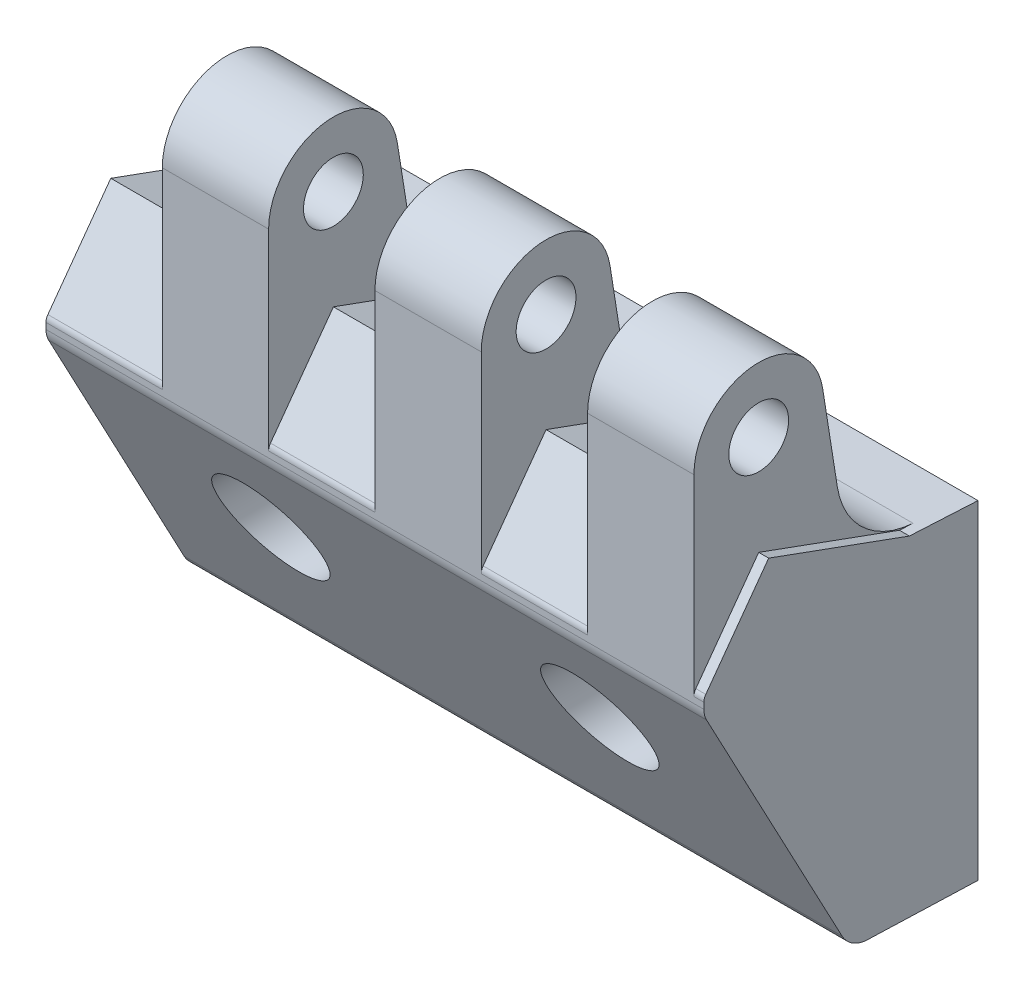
ISO-10303-21;
HEADER;
FILE_DESCRIPTION(('STEP AP214'),'2;1');
FILE_NAME('part.step','',(''),(''),'','','');
FILE_SCHEMA(('AUTOMOTIVE_DESIGN { 1 0 10303 214 1 1 1 1 }'));
ENDSEC;
DATA;
#1=APPLICATION_CONTEXT('core data for automotive mechanical design processes');
#2=APPLICATION_PROTOCOL_DEFINITION('international standard','automotive_design',2000,#1);
#3=PRODUCT_CONTEXT('',#1,'mechanical');
#4=PRODUCT('Part','Part','',(#3));
#5=PRODUCT_RELATED_PRODUCT_CATEGORY('part','',(#4));
#6=PRODUCT_DEFINITION_FORMATION('','',#4);
#7=PRODUCT_DEFINITION_CONTEXT('part definition',#1,'design');
#8=PRODUCT_DEFINITION('design','',#6,#7);
#9=PRODUCT_DEFINITION_SHAPE('','',#8);
#10=(LENGTH_UNIT() NAMED_UNIT(*) SI_UNIT(.MILLI.,.METRE.));
#11=(NAMED_UNIT(*) PLANE_ANGLE_UNIT() SI_UNIT($,.RADIAN.));
#12=(NAMED_UNIT(*) SI_UNIT($,.STERADIAN.) SOLID_ANGLE_UNIT());
#13=UNCERTAINTY_MEASURE_WITH_UNIT(LENGTH_MEASURE(1.E-05),#10,'distance_accuracy_value','');
#14=(GEOMETRIC_REPRESENTATION_CONTEXT(3) GLOBAL_UNCERTAINTY_ASSIGNED_CONTEXT((#13)) GLOBAL_UNIT_ASSIGNED_CONTEXT((#10,
#11,#12)) REPRESENTATION_CONTEXT('',''));
#15=CARTESIAN_POINT('',(0.,0.,0.));
#16=DIRECTION('',(0.,0.,1.));
#17=DIRECTION('',(1.,0.,0.));
#18=AXIS2_PLACEMENT_3D('',#15,#16,#17);
#19=CARTESIAN_POINT('',(-16.5,16.35,0.));
#20=DIRECTION('',(0.,0.998629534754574,-0.0523359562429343));
#21=DIRECTION('',(0.,0.0523359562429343,0.998629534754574));
#22=AXIS2_PLACEMENT_3D('',#19,#20,#21);
#23=PLANE('',#22);
#24=DIRECTION('',(-1.,0.,0.));
#25=VECTOR('',#24,1.);
#26=CARTESIAN_POINT('',(48.5,16.6393206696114,5.520567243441));
#27=LINE('',#26,#25);
#28=CARTESIAN_POINT('',(37.833333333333,16.6393206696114,5.52056724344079));
#29=VERTEX_POINT('',#28);
#30=CARTESIAN_POINT('',(48.5,16.6393206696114,5.520567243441));
#31=VERTEX_POINT('',#30);
#32=EDGE_CURVE('E29',#29,#31,#27,.F.);
#33=ORIENTED_EDGE('',*,*,#32,.T.);
#34=DIRECTION('',(0.,0.0523359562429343,0.998629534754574));
#35=VECTOR('',#34,1.);
#36=CARTESIAN_POINT('',(48.5,16.35,0.));
#37=LINE('',#36,#35);
#38=CARTESIAN_POINT('',(48.5,16.71068751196,6.8823277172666));
#39=VERTEX_POINT('',#38);
#40=EDGE_CURVE('E305',#31,#39,#37,.T.);
#41=ORIENTED_EDGE('',*,*,#40,.T.);
#42=DIRECTION('',(1.,0.,0.));
#43=VECTOR('',#42,1.);
#44=CARTESIAN_POINT('',(-16.5,16.71068751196,6.8823277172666));
#45=LINE('',#44,#43);
#46=CARTESIAN_POINT('',(49.5,16.71068751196,6.8823277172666));
#47=VERTEX_POINT('',#46);
#48=EDGE_CURVE('E508',#39,#47,#45,.T.);
#49=ORIENTED_EDGE('',*,*,#48,.T.);
#50=DIRECTION('',(0.,0.0523359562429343,0.998629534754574));
#51=VECTOR('',#50,1.);
#52=CARTESIAN_POINT('',(49.5,16.35,0.));
#53=LINE('',#52,#51);
#54=CARTESIAN_POINT('',(49.5,16.35,0.));
#55=VERTEX_POINT('',#54);
#56=EDGE_CURVE('E428',#55,#47,#53,.T.);
#57=ORIENTED_EDGE('',*,*,#56,.F.);
#58=DIRECTION('',(1.,0.,0.));
#59=VECTOR('',#58,1.);
#60=CARTESIAN_POINT('',(-16.5,16.35,0.));
#61=LINE('',#60,#59);
#62=CARTESIAN_POINT('',(-16.5,16.35,0.));
#63=VERTEX_POINT('',#62);
#64=EDGE_CURVE('E514',#63,#55,#61,.T.);
#65=ORIENTED_EDGE('',*,*,#64,.F.);
#66=DIRECTION('',(0.,0.0523359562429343,0.998629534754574));
#67=VECTOR('',#66,1.);
#68=CARTESIAN_POINT('',(-16.5,16.35,0.));
#69=LINE('',#68,#67);
#70=CARTESIAN_POINT('',(-16.5,16.71068751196,6.8823277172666));
#71=VERTEX_POINT('',#70);
#72=EDGE_CURVE('E458',#63,#71,#69,.T.);
#73=ORIENTED_EDGE('',*,*,#72,.T.);
#74=CARTESIAN_POINT('',(-4.833333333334,16.71068751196,6.8823277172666));
#75=VERTEX_POINT('',#74);
#76=EDGE_CURVE('E511',#71,#75,#45,.T.);
#77=ORIENTED_EDGE('',*,*,#76,.T.);
#78=DIRECTION('',(0.,0.0523359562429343,0.998629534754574));
#79=VECTOR('',#78,1.);
#80=CARTESIAN_POINT('',(-4.833333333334,16.35,0.));
#81=LINE('',#80,#79);
#82=CARTESIAN_POINT('',(-4.833333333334,16.6393206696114,5.52056724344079));
#83=VERTEX_POINT('',#82);
#84=EDGE_CURVE('E364',#83,#75,#81,.T.);
#85=ORIENTED_EDGE('',*,*,#84,.F.);
#86=DIRECTION('',(1.,0.,0.));
#87=VECTOR('',#86,1.);
#88=CARTESIAN_POINT('',(-4.833333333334,16.6393206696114,5.520567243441));
#89=LINE('',#88,#87);
#90=CARTESIAN_POINT('',(5.833333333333,16.6393206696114,5.52056724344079));
#91=VERTEX_POINT('',#90);
#92=EDGE_CURVE('E522',#91,#83,#89,.F.);
#93=ORIENTED_EDGE('',*,*,#92,.F.);
#94=DIRECTION('',(0.,0.0523359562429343,0.998629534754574));
#95=VECTOR('',#94,1.);
#96=CARTESIAN_POINT('',(5.833333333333,16.35,0.));
#97=LINE('',#96,#95);
#98=CARTESIAN_POINT('',(5.833333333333,16.71068751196,6.8823277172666));
#99=VERTEX_POINT('',#98);
#100=EDGE_CURVE('E355',#91,#99,#97,.T.);
#101=ORIENTED_EDGE('',*,*,#100,.T.);
#102=CARTESIAN_POINT('',(16.5,16.71068751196,6.8823277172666));
#103=VERTEX_POINT('',#102);
#104=EDGE_CURVE('E515',#99,#103,#45,.T.);
#105=ORIENTED_EDGE('',*,*,#104,.T.);
#106=DIRECTION('',(0.,0.0523359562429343,0.998629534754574));
#107=VECTOR('',#106,1.);
#108=CARTESIAN_POINT('',(16.5,16.35,0.));
#109=LINE('',#108,#107);
#110=CARTESIAN_POINT('',(16.5,16.6393206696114,5.52056724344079));
#111=VERTEX_POINT('',#110);
#112=EDGE_CURVE('E413',#111,#103,#109,.T.);
#113=ORIENTED_EDGE('',*,*,#112,.F.);
#114=DIRECTION('',(-1.,0.,0.));
#115=VECTOR('',#114,1.);
#116=CARTESIAN_POINT('',(27.166666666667,16.6393206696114,5.520567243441));
#117=LINE('',#116,#115);
#118=CARTESIAN_POINT('',(27.166666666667,16.6393206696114,5.520567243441));
#119=VERTEX_POINT('',#118);
#120=EDGE_CURVE('E520',#111,#119,#117,.F.);
#121=ORIENTED_EDGE('',*,*,#120,.T.);
#122=DIRECTION('',(0.,0.0523359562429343,0.998629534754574));
#123=VECTOR('',#122,1.);
#124=CARTESIAN_POINT('',(27.166666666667,16.35,0.));
#125=LINE('',#124,#123);
#126=CARTESIAN_POINT('',(27.166666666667,16.71068751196,6.8823277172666));
#127=VERTEX_POINT('',#126);
#128=EDGE_CURVE('E422',#119,#127,#125,.T.);
#129=ORIENTED_EDGE('',*,*,#128,.T.);
#130=CARTESIAN_POINT('',(37.833333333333,16.71068751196,6.8823277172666));
#131=VERTEX_POINT('',#130);
#132=EDGE_CURVE('E516',#127,#131,#45,.T.);
#133=ORIENTED_EDGE('',*,*,#132,.T.);
#134=DIRECTION('',(0.,0.0523359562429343,0.998629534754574));
#135=VECTOR('',#134,1.);
#136=CARTESIAN_POINT('',(37.833333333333,16.35,0.));
#137=LINE('',#136,#135);
#138=EDGE_CURVE('E34',#29,#131,#137,.T.);
#139=ORIENTED_EDGE('',*,*,#138,.F.);
#140=EDGE_LOOP('',(#33,#41,#49,#57,#65,#73,#77,#85,#93,#101,#105,#113,#121,#129,#133,#139));
#141=FACE_BOUND('',#140,.T.);
#142=ADVANCED_FACE('F14',(#141),#23,.T.);
#143=CARTESIAN_POINT('',(-16.5,16.71068751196,6.8823277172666));
#144=DIRECTION('',(0.,0.939692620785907,-0.342020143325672));
#145=DIRECTION('',(0.,0.342020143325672,0.939692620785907));
#146=AXIS2_PLACEMENT_3D('',#143,#144,#145);
#147=PLANE('',#146);
#148=ORIENTED_EDGE('',*,*,#48,.F.);
#149=DIRECTION('',(0.,0.342020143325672,0.939692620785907));
#150=VECTOR('',#149,1.);
#151=CARTESIAN_POINT('',(48.5,16.71068751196,6.8823277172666));
#152=LINE('',#151,#150);
#153=CARTESIAN_POINT('',(48.5,21.8491,21.));
#154=VERTEX_POINT('',#153);
#155=EDGE_CURVE('E303',#39,#154,#152,.T.);
#156=ORIENTED_EDGE('',*,*,#155,.T.);
#157=DIRECTION('',(1.,0.,0.));
#158=VECTOR('',#157,1.);
#159=CARTESIAN_POINT('',(-16.5,21.8491,21.));
#160=LINE('',#159,#158);
#161=CARTESIAN_POINT('',(49.5,21.8491,21.));
#162=VERTEX_POINT('',#161);
#163=EDGE_CURVE('E502',#154,#162,#160,.T.);
#164=ORIENTED_EDGE('',*,*,#163,.T.);
#165=DIRECTION('',(0.,0.342020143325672,0.939692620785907));
#166=VECTOR('',#165,1.);
#167=CARTESIAN_POINT('',(49.5,16.71068751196,6.8823277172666));
#168=LINE('',#167,#166);
#169=EDGE_CURVE('E431',#47,#162,#168,.T.);
#170=ORIENTED_EDGE('',*,*,#169,.F.);
#171=EDGE_LOOP('',(#148,#156,#164,#170));
#172=FACE_BOUND('',#171,.T.);
#173=ADVANCED_FACE('F634',(#172),#147,.T.);
#174=CARTESIAN_POINT('',(-16.5,21.8491,21.));
#175=DIRECTION('',(0.,0.587785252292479,0.809016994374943));
#176=DIRECTION('',(0.,-0.809016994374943,0.587785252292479));
#177=AXIS2_PLACEMENT_3D('',#174,#175,#176);
#178=PLANE('',#177);
#179=ORIENTED_EDGE('',*,*,#163,.F.);
#180=DIRECTION('',(0.,-0.809016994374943,0.587785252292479));
#181=VECTOR('',#180,1.);
#182=CARTESIAN_POINT('',(48.5,21.8491,21.));
#183=LINE('',#182,#181);
#184=CARTESIAN_POINT('',(48.5,13.165483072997,27.309016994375));
#185=VERTEX_POINT('',#184);
#186=EDGE_CURVE('E301',#154,#185,#183,.T.);
#187=ORIENTED_EDGE('',*,*,#186,.T.);
#188=DIRECTION('',(1.,0.,0.));
#189=VECTOR('',#188,1.);
#190=CARTESIAN_POINT('',(-16.5,13.165483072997,27.309016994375));
#191=LINE('',#190,#189);
#192=CARTESIAN_POINT('',(49.5,13.165483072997,27.309016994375));
#193=VERTEX_POINT('',#192);
#194=EDGE_CURVE('E496',#185,#193,#191,.T.);
#195=ORIENTED_EDGE('',*,*,#194,.T.);
#196=DIRECTION('',(0.,-0.809016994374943,0.587785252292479));
#197=VECTOR('',#196,1.);
#198=CARTESIAN_POINT('',(49.5,21.8491,21.));
#199=LINE('',#198,#197);
#200=EDGE_CURVE('E434',#162,#193,#199,.T.);
#201=ORIENTED_EDGE('',*,*,#200,.F.);
#202=EDGE_LOOP('',(#179,#187,#195,#201));
#203=FACE_BOUND('',#202,.T.);
#204=ADVANCED_FACE('F599',(#203),#178,.T.);
#205=CARTESIAN_POINT('',(-16.5,12.5776978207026,26.4999999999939));
#206=DIRECTION('',(1.,0.,0.));
#207=DIRECTION('',(0.,1.,0.));
#208=AXIS2_PLACEMENT_3D('',#205,#206,#207);
#209=CYLINDRICAL_SURFACE('',#208,1.0000000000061);
#210=ORIENTED_EDGE('',*,*,#194,.F.);
#211=CARTESIAN_POINT('',(48.5,12.5776978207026,26.4999999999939));
#212=DIRECTION('',(-1.,0.,0.));
#213=DIRECTION('',(0.,-1.,0.));
#214=AXIS2_PLACEMENT_3D('',#211,#212,#213);
#215=CIRCLE('',#214,1.0000000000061);
#216=CARTESIAN_POINT('',(48.5,12.577697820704,27.5));
#217=VERTEX_POINT('',#216);
#218=EDGE_CURVE('E299',#185,#217,#215,.F.);
#219=ORIENTED_EDGE('',*,*,#218,.T.);
#220=DIRECTION('',(1.,0.,0.));
#221=VECTOR('',#220,1.);
#222=CARTESIAN_POINT('',(-16.5,12.577697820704,27.5));
#223=LINE('',#222,#221);
#224=CARTESIAN_POINT('',(49.5,12.577697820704,27.5));
#225=VERTEX_POINT('',#224);
#226=EDGE_CURVE('E492',#217,#225,#223,.T.);
#227=ORIENTED_EDGE('',*,*,#226,.T.);
#228=CARTESIAN_POINT('',(49.5,12.5776978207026,26.4999999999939));
#229=DIRECTION('',(1.,0.,0.));
#230=DIRECTION('',(0.,1.,0.));
#231=AXIS2_PLACEMENT_3D('',#228,#229,#230);
#232=CIRCLE('',#231,1.0000000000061);
#233=EDGE_CURVE('E437',#193,#225,#232,.T.);
#234=ORIENTED_EDGE('',*,*,#233,.F.);
#235=EDGE_LOOP('',(#210,#219,#227,#234));
#236=FACE_BOUND('',#235,.T.);
#237=ADVANCED_FACE('F605',(#236),#209,.T.);
#238=ORIENTED_EDGE('',*,*,#104,.F.);
#239=DIRECTION('',(0.,0.342020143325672,0.939692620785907));
#240=VECTOR('',#239,1.);
#241=CARTESIAN_POINT('',(5.833333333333,16.71068751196,6.8823277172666));
#242=LINE('',#241,#240);
#243=CARTESIAN_POINT('',(5.833333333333,21.8491,21.));
#244=VERTEX_POINT('',#243);
#245=EDGE_CURVE('E352',#99,#244,#242,.T.);
#246=ORIENTED_EDGE('',*,*,#245,.T.);
#247=CARTESIAN_POINT('',(16.5,21.8491,21.));
#248=VERTEX_POINT('',#247);
#249=EDGE_CURVE('E509',#244,#248,#160,.T.);
#250=ORIENTED_EDGE('',*,*,#249,.T.);
#251=DIRECTION('',(0.,0.342020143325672,0.939692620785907));
#252=VECTOR('',#251,1.);
#253=CARTESIAN_POINT('',(16.5,16.71068751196,6.8823277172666));
#254=LINE('',#253,#252);
#255=EDGE_CURVE('E410',#103,#248,#254,.T.);
#256=ORIENTED_EDGE('',*,*,#255,.F.);
#257=EDGE_LOOP('',(#238,#246,#250,#256));
#258=FACE_BOUND('',#257,.T.);
#259=ADVANCED_FACE('F559',(#258),#147,.T.);
#260=ORIENTED_EDGE('',*,*,#249,.F.);
#261=DIRECTION('',(0.,-0.809016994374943,0.587785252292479));
#262=VECTOR('',#261,1.);
#263=CARTESIAN_POINT('',(5.833333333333,21.8491,21.));
#264=LINE('',#263,#262);
#265=CARTESIAN_POINT('',(5.833333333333,13.165483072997,27.309016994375));
#266=VERTEX_POINT('',#265);
#267=EDGE_CURVE('E349',#244,#266,#264,.T.);
#268=ORIENTED_EDGE('',*,*,#267,.T.);
#269=CARTESIAN_POINT('',(16.5,13.165483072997,27.309016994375));
#270=VERTEX_POINT('',#269);
#271=EDGE_CURVE('E503',#266,#270,#191,.T.);
#272=ORIENTED_EDGE('',*,*,#271,.T.);
#273=DIRECTION('',(0.,-0.809016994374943,0.587785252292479));
#274=VECTOR('',#273,1.);
#275=CARTESIAN_POINT('',(16.5,21.8491,21.));
#276=LINE('',#275,#274);
#277=EDGE_CURVE('E407',#248,#270,#276,.T.);
#278=ORIENTED_EDGE('',*,*,#277,.F.);
#279=EDGE_LOOP('',(#260,#268,#272,#278));
#280=FACE_BOUND('',#279,.T.);
#281=ADVANCED_FACE('F697',(#280),#178,.T.);
#282=ORIENTED_EDGE('',*,*,#271,.F.);
#283=CARTESIAN_POINT('',(5.833333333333,12.5776978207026,26.4999999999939));
#284=DIRECTION('',(-1.,0.,0.));
#285=DIRECTION('',(0.,-1.,0.));
#286=AXIS2_PLACEMENT_3D('',#283,#284,#285);
#287=CIRCLE('',#286,1.0000000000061);
#288=CARTESIAN_POINT('',(5.833333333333,12.577697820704,27.5));
#289=VERTEX_POINT('',#288);
#290=EDGE_CURVE('E346',#266,#289,#287,.F.);
#291=ORIENTED_EDGE('',*,*,#290,.T.);
#292=CARTESIAN_POINT('',(16.5,12.577697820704,27.5));
#293=VERTEX_POINT('',#292);
#294=EDGE_CURVE('E497',#289,#293,#223,.T.);
#295=ORIENTED_EDGE('',*,*,#294,.T.);
#296=CARTESIAN_POINT('',(16.5,12.5776978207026,26.4999999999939));
#297=DIRECTION('',(-1.,0.,0.));
#298=DIRECTION('',(0.,-1.,0.));
#299=AXIS2_PLACEMENT_3D('',#296,#297,#298);
#300=CIRCLE('',#299,1.0000000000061);
#301=EDGE_CURVE('E404',#270,#293,#300,.F.);
#302=ORIENTED_EDGE('',*,*,#301,.F.);
#303=EDGE_LOOP('',(#282,#291,#295,#302));
#304=FACE_BOUND('',#303,.T.);
#305=ADVANCED_FACE('F613',(#304),#209,.T.);
#306=DIRECTION('',(0.,0.342020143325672,0.939692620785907));
#307=VECTOR('',#306,1.);
#308=CARTESIAN_POINT('',(37.833333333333,16.71068751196,6.8823277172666));
#309=LINE('',#308,#307);
#310=CARTESIAN_POINT('',(37.833333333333,21.8491,21.));
#311=VERTEX_POINT('',#310);
#312=EDGE_CURVE('E295',#131,#311,#309,.T.);
#313=ORIENTED_EDGE('',*,*,#312,.F.);
#314=ORIENTED_EDGE('',*,*,#132,.F.);
#315=DIRECTION('',(0.,0.342020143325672,0.939692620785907));
#316=VECTOR('',#315,1.);
#317=CARTESIAN_POINT('',(27.166666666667,16.71068751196,6.8823277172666));
#318=LINE('',#317,#316);
#319=CARTESIAN_POINT('',(27.166666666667,21.8491,21.));
#320=VERTEX_POINT('',#319);
#321=EDGE_CURVE('E420',#127,#320,#318,.T.);
#322=ORIENTED_EDGE('',*,*,#321,.T.);
#323=EDGE_CURVE('E510',#320,#311,#160,.T.);
#324=ORIENTED_EDGE('',*,*,#323,.T.);
#325=EDGE_LOOP('',(#313,#314,#322,#324));
#326=FACE_BOUND('',#325,.T.);
#327=ADVANCED_FACE('F586',(#326),#147,.T.);
#328=DIRECTION('',(0.,-0.809016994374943,0.587785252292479));
#329=VECTOR('',#328,1.);
#330=CARTESIAN_POINT('',(37.833333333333,21.8491,21.));
#331=LINE('',#330,#329);
#332=CARTESIAN_POINT('',(37.833333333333,13.165483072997,27.309016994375));
#333=VERTEX_POINT('',#332);
#334=EDGE_CURVE('E292',#311,#333,#331,.T.);
#335=ORIENTED_EDGE('',*,*,#334,.F.);
#336=ORIENTED_EDGE('',*,*,#323,.F.);
#337=DIRECTION('',(0.,-0.809016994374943,0.587785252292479));
#338=VECTOR('',#337,1.);
#339=CARTESIAN_POINT('',(27.166666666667,21.8491,21.));
#340=LINE('',#339,#338);
#341=CARTESIAN_POINT('',(27.166666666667,13.165483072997,27.309016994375));
#342=VERTEX_POINT('',#341);
#343=EDGE_CURVE('E418',#320,#342,#340,.T.);
#344=ORIENTED_EDGE('',*,*,#343,.T.);
#345=EDGE_CURVE('E504',#342,#333,#191,.T.);
#346=ORIENTED_EDGE('',*,*,#345,.T.);
#347=EDGE_LOOP('',(#335,#336,#344,#346));
#348=FACE_BOUND('',#347,.T.);
#349=ADVANCED_FACE('F591',(#348),#178,.T.);
#350=CARTESIAN_POINT('',(37.833333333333,12.5776978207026,26.4999999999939));
#351=DIRECTION('',(-1.,0.,0.));
#352=DIRECTION('',(0.,-1.,0.));
#353=AXIS2_PLACEMENT_3D('',#350,#351,#352);
#354=CIRCLE('',#353,1.0000000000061);
#355=CARTESIAN_POINT('',(37.833333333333,12.577697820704,27.5));
#356=VERTEX_POINT('',#355);
#357=EDGE_CURVE('E251',#333,#356,#354,.F.);
#358=ORIENTED_EDGE('',*,*,#357,.F.);
#359=ORIENTED_EDGE('',*,*,#345,.F.);
#360=CARTESIAN_POINT('',(27.166666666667,12.5776978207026,26.4999999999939));
#361=DIRECTION('',(-1.,0.,0.));
#362=DIRECTION('',(0.,-1.,0.));
#363=AXIS2_PLACEMENT_3D('',#360,#361,#362);
#364=CIRCLE('',#363,1.0000000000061);
#365=CARTESIAN_POINT('',(27.166666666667,12.577697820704,27.5));
#366=VERTEX_POINT('',#365);
#367=EDGE_CURVE('E416',#342,#366,#364,.F.);
#368=ORIENTED_EDGE('',*,*,#367,.T.);
#369=EDGE_CURVE('E498',#366,#356,#223,.T.);
#370=ORIENTED_EDGE('',*,*,#369,.T.);
#371=EDGE_LOOP('',(#358,#359,#368,#370));
#372=FACE_BOUND('',#371,.T.);
#373=ADVANCED_FACE('F653',(#372),#209,.T.);
#374=CARTESIAN_POINT('',(-16.5,-16.262685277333,11.091242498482));
#375=DIRECTION('',(0.,-0.999390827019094,0.0348994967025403));
#376=DIRECTION('',(0.,-0.0348994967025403,-0.999390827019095));
#377=AXIS2_PLACEMENT_3D('',#374,#375,#376);
#378=PLANE('',#377);
#379=DIRECTION('',(1.,0.,0.));
#380=VECTOR('',#379,1.);
#381=CARTESIAN_POINT('',(-16.5,-16.65,0.));
#382=LINE('',#381,#380);
#383=CARTESIAN_POINT('',(-16.5,-16.65,0.));
#384=VERTEX_POINT('',#383);
#385=CARTESIAN_POINT('',(49.5,-16.65,0.));
#386=VERTEX_POINT('',#385);
#387=EDGE_CURVE('E518',#384,#386,#382,.T.);
#388=ORIENTED_EDGE('',*,*,#387,.T.);
#389=DIRECTION('',(0.,-0.0348994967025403,-0.999390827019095));
#390=VECTOR('',#389,1.);
#391=CARTESIAN_POINT('',(49.5,-16.262685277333,11.091242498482));
#392=LINE('',#391,#390);
#393=CARTESIAN_POINT('',(49.5,-16.262685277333,11.091242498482));
#394=VERTEX_POINT('',#393);
#395=EDGE_CURVE('E424',#394,#386,#392,.T.);
#396=ORIENTED_EDGE('',*,*,#395,.F.);
#397=DIRECTION('',(1.,0.,0.));
#398=VECTOR('',#397,1.);
#399=CARTESIAN_POINT('',(-16.5,-16.262685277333,11.091242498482));
#400=LINE('',#399,#398);
#401=CARTESIAN_POINT('',(-16.5,-16.262685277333,11.091242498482));
#402=VERTEX_POINT('',#401);
#403=EDGE_CURVE('E482',#402,#394,#400,.T.);
#404=ORIENTED_EDGE('',*,*,#403,.F.);
#405=DIRECTION('',(0.,-0.0348994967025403,-0.999390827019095));
#406=VECTOR('',#405,1.);
#407=CARTESIAN_POINT('',(-16.5,-16.262685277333,11.091242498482));
#408=LINE('',#407,#406);
#409=EDGE_CURVE('E452',#402,#384,#408,.T.);
#410=ORIENTED_EDGE('',*,*,#409,.T.);
#411=EDGE_LOOP('',(#388,#396,#404,#410));
#412=FACE_BOUND('',#411,.T.);
#413=ADVANCED_FACE('F16',(#412),#378,.T.);
#414=CARTESIAN_POINT('',(-16.5,-16.65,0.));
#415=DIRECTION('',(0.,0.,-1.));
#416=DIRECTION('',(-1.,0.,0.));
#417=AXIS2_PLACEMENT_3D('',#414,#415,#416);
#418=PLANE('',#417);
#419=CARTESIAN_POINT('',(0.,0.,0.));
#420=DIRECTION('',(0.,0.,1.));
#421=DIRECTION('',(0.,-1.,0.));
#422=AXIS2_PLACEMENT_3D('',#419,#420,#421);
#423=CIRCLE('',#422,3.25);
#424=CARTESIAN_POINT('',(0.,-3.25,0.));
#425=VERTEX_POINT('',#424);
#426=EDGE_CURVE('E657',#425,#425,#423,.T.);
#427=ORIENTED_EDGE('',*,*,#426,.T.);
#428=EDGE_LOOP('',(#427));
#429=FACE_BOUND('',#428,.T.);
#430=CARTESIAN_POINT('',(33.,0.,0.));
#431=DIRECTION('',(0.,0.,1.));
#432=DIRECTION('',(0.,-1.,0.));
#433=AXIS2_PLACEMENT_3D('',#430,#431,#432);
#434=CIRCLE('',#433,3.25);
#435=CARTESIAN_POINT('',(33.,-3.25,0.));
#436=VERTEX_POINT('',#435);
#437=EDGE_CURVE('E660',#436,#436,#434,.T.);
#438=ORIENTED_EDGE('',*,*,#437,.T.);
#439=EDGE_LOOP('',(#438));
#440=FACE_BOUND('',#439,.T.);
#441=ORIENTED_EDGE('',*,*,#64,.T.);
#442=DIRECTION('',(0.,1.,0.));
#443=VECTOR('',#442,1.);
#444=CARTESIAN_POINT('',(49.5,-16.65,0.));
#445=LINE('',#444,#443);
#446=EDGE_CURVE('E425',#386,#55,#445,.T.);
#447=ORIENTED_EDGE('',*,*,#446,.F.);
#448=ORIENTED_EDGE('',*,*,#387,.F.);
#449=DIRECTION('',(0.,1.,0.));
#450=VECTOR('',#449,1.);
#451=CARTESIAN_POINT('',(-16.5,-16.65,0.));
#452=LINE('',#451,#450);
#453=EDGE_CURVE('E455',#384,#63,#452,.T.);
#454=ORIENTED_EDGE('',*,*,#453,.T.);
#455=EDGE_LOOP('',(#441,#447,#448,#454));
#456=FACE_BOUND('',#455,.T.);
#457=ADVANCED_FACE('F643',(#429,#440,#456),#418,.T.);
#458=DIRECTION('',(0.,0.342020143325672,0.939692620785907));
#459=VECTOR('',#458,1.);
#460=CARTESIAN_POINT('',(-4.833333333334,16.71068751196,6.8823277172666));
#461=LINE('',#460,#459);
#462=CARTESIAN_POINT('',(-4.833333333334,21.8491,21.));
#463=VERTEX_POINT('',#462);
#464=EDGE_CURVE('E362',#75,#463,#461,.T.);
#465=ORIENTED_EDGE('',*,*,#464,.F.);
#466=ORIENTED_EDGE('',*,*,#76,.F.);
#467=DIRECTION('',(0.,0.342020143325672,0.939692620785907));
#468=VECTOR('',#467,1.);
#469=CARTESIAN_POINT('',(-16.5,16.71068751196,6.8823277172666));
#470=LINE('',#469,#468);
#471=CARTESIAN_POINT('',(-16.5,21.8491,21.));
#472=VERTEX_POINT('',#471);
#473=EDGE_CURVE('E461',#71,#472,#470,.T.);
#474=ORIENTED_EDGE('',*,*,#473,.T.);
#475=EDGE_CURVE('E505',#472,#463,#160,.T.);
#476=ORIENTED_EDGE('',*,*,#475,.T.);
#477=EDGE_LOOP('',(#465,#466,#474,#476));
#478=FACE_BOUND('',#477,.T.);
#479=ADVANCED_FACE('F641',(#478),#147,.T.);
#480=DIRECTION('',(0.,-0.809016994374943,0.587785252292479));
#481=VECTOR('',#480,1.);
#482=CARTESIAN_POINT('',(-4.833333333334,21.8491,21.));
#483=LINE('',#482,#481);
#484=CARTESIAN_POINT('',(-4.833333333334,13.165483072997,27.309016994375));
#485=VERTEX_POINT('',#484);
#486=EDGE_CURVE('E360',#463,#485,#483,.T.);
#487=ORIENTED_EDGE('',*,*,#486,.F.);
#488=ORIENTED_EDGE('',*,*,#475,.F.);
#489=DIRECTION('',(0.,-0.809016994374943,0.587785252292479));
#490=VECTOR('',#489,1.);
#491=CARTESIAN_POINT('',(-16.5,21.8491,21.));
#492=LINE('',#491,#490);
#493=CARTESIAN_POINT('',(-16.5,13.165483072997,27.309016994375));
#494=VERTEX_POINT('',#493);
#495=EDGE_CURVE('E464',#472,#494,#492,.T.);
#496=ORIENTED_EDGE('',*,*,#495,.T.);
#497=EDGE_CURVE('E499',#494,#485,#191,.T.);
#498=ORIENTED_EDGE('',*,*,#497,.T.);
#499=EDGE_LOOP('',(#487,#488,#496,#498));
#500=FACE_BOUND('',#499,.T.);
#501=ADVANCED_FACE('F651',(#500),#178,.T.);
#502=CARTESIAN_POINT('',(-4.833333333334,12.5776978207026,26.4999999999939));
#503=DIRECTION('',(-1.,0.,0.));
#504=DIRECTION('',(0.,-1.,0.));
#505=AXIS2_PLACEMENT_3D('',#502,#503,#504);
#506=CIRCLE('',#505,1.0000000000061);
#507=CARTESIAN_POINT('',(-4.833333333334,12.577697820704,27.5));
#508=VERTEX_POINT('',#507);
#509=EDGE_CURVE('E358',#485,#508,#506,.F.);
#510=ORIENTED_EDGE('',*,*,#509,.F.);
#511=ORIENTED_EDGE('',*,*,#497,.F.);
#512=CARTESIAN_POINT('',(-16.5,12.5776978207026,26.4999999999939));
#513=DIRECTION('',(1.,0.,0.));
#514=DIRECTION('',(0.,1.,0.));
#515=AXIS2_PLACEMENT_3D('',#512,#513,#514);
#516=CIRCLE('',#515,1.0000000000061);
#517=CARTESIAN_POINT('',(-16.5,12.577697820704,27.5));
#518=VERTEX_POINT('',#517);
#519=EDGE_CURVE('E467',#494,#518,#516,.T.);
#520=ORIENTED_EDGE('',*,*,#519,.T.);
#521=EDGE_CURVE('E493',#518,#508,#223,.T.);
#522=ORIENTED_EDGE('',*,*,#521,.T.);
#523=EDGE_LOOP('',(#510,#511,#520,#522));
#524=FACE_BOUND('',#523,.T.);
#525=ADVANCED_FACE('F678',(#524),#209,.T.);
#526=CARTESIAN_POINT('',(-16.5,12.577697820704,27.5));
#527=DIRECTION('',(0.,0.,1.));
#528=DIRECTION('',(1.,0.,0.));
#529=AXIS2_PLACEMENT_3D('',#526,#527,#528);
#530=PLANE('',#529);
#531=ORIENTED_EDGE('',*,*,#226,.F.);
#532=DIRECTION('',(0.,-1.,0.));
#533=VECTOR('',#532,1.);
#534=CARTESIAN_POINT('',(48.5,31.85,27.5));
#535=LINE('',#534,#533);
#536=CARTESIAN_POINT('',(48.5,31.85,27.5));
#537=VERTEX_POINT('',#536);
#538=EDGE_CURVE('E275',#537,#217,#535,.T.);
#539=ORIENTED_EDGE('',*,*,#538,.F.);
#540=DIRECTION('',(-1.,0.,0.));
#541=VECTOR('',#540,1.);
#542=CARTESIAN_POINT('',(48.5,31.85,27.5));
#543=LINE('',#542,#541);
#544=CARTESIAN_POINT('',(37.833333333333,31.85,27.5));
#545=VERTEX_POINT('',#544);
#546=EDGE_CURVE('E286',#537,#545,#543,.T.);
#547=ORIENTED_EDGE('',*,*,#546,.T.);
#548=DIRECTION('',(0.,-1.,0.));
#549=VECTOR('',#548,1.);
#550=CARTESIAN_POINT('',(37.833333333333,31.85,27.5));
#551=LINE('',#550,#549);
#552=EDGE_CURVE('E244',#545,#356,#551,.T.);
#553=ORIENTED_EDGE('',*,*,#552,.T.);
#554=ORIENTED_EDGE('',*,*,#369,.F.);
#555=DIRECTION('',(0.,-1.,0.));
#556=VECTOR('',#555,1.);
#557=CARTESIAN_POINT('',(27.166666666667,31.85,27.5));
#558=LINE('',#557,#556);
#559=CARTESIAN_POINT('',(27.166666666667,31.85,27.5));
#560=VERTEX_POINT('',#559);
#561=EDGE_CURVE('E383',#560,#366,#558,.T.);
#562=ORIENTED_EDGE('',*,*,#561,.F.);
#563=DIRECTION('',(-1.,0.,0.));
#564=VECTOR('',#563,1.);
#565=CARTESIAN_POINT('',(27.166666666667,31.85,27.5));
#566=LINE('',#565,#564);
#567=CARTESIAN_POINT('',(16.5,31.85,27.5));
#568=VERTEX_POINT('',#567);
#569=EDGE_CURVE('E395',#560,#568,#566,.T.);
#570=ORIENTED_EDGE('',*,*,#569,.T.);
#571=DIRECTION('',(0.,-1.,0.));
#572=VECTOR('',#571,1.);
#573=CARTESIAN_POINT('',(16.5,31.85,27.5));
#574=LINE('',#573,#572);
#575=EDGE_CURVE('E366',#568,#293,#574,.T.);
#576=ORIENTED_EDGE('',*,*,#575,.T.);
#577=ORIENTED_EDGE('',*,*,#294,.F.);
#578=DIRECTION('',(0.,-1.,0.));
#579=VECTOR('',#578,1.);
#580=CARTESIAN_POINT('',(5.833333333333,31.85,27.5));
#581=LINE('',#580,#579);
#582=CARTESIAN_POINT('',(5.833333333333,31.85,27.5));
#583=VERTEX_POINT('',#582);
#584=EDGE_CURVE('E307',#583,#289,#581,.T.);
#585=ORIENTED_EDGE('',*,*,#584,.F.);
#586=DIRECTION('',(1.,0.,0.));
#587=VECTOR('',#586,1.);
#588=CARTESIAN_POINT('',(-4.833333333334,31.85,27.5));
#589=LINE('',#588,#587);
#590=CARTESIAN_POINT('',(-4.833333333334,31.85,27.5));
#591=VERTEX_POINT('',#590);
#592=EDGE_CURVE('E339',#591,#583,#589,.T.);
#593=ORIENTED_EDGE('',*,*,#592,.F.);
#594=DIRECTION('',(0.,-1.,0.));
#595=VECTOR('',#594,1.);
#596=CARTESIAN_POINT('',(-4.833333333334,31.85,27.5));
#597=LINE('',#596,#595);
#598=EDGE_CURVE('E325',#591,#508,#597,.T.);
#599=ORIENTED_EDGE('',*,*,#598,.T.);
#600=ORIENTED_EDGE('',*,*,#521,.F.);
#601=DIRECTION('',(0.,-1.,0.));
#602=VECTOR('',#601,1.);
#603=CARTESIAN_POINT('',(-16.5,12.577697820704,27.5));
#604=LINE('',#603,#602);
#605=CARTESIAN_POINT('',(-16.5,11.963605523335,27.5));
#606=VERTEX_POINT('',#605);
#607=EDGE_CURVE('E470',#518,#606,#604,.T.);
#608=ORIENTED_EDGE('',*,*,#607,.T.);
#609=DIRECTION('',(1.,0.,0.));
#610=VECTOR('',#609,1.);
#611=CARTESIAN_POINT('',(-16.5,11.963605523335,27.5));
#612=LINE('',#611,#610);
#613=CARTESIAN_POINT('',(49.5,11.963605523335,27.5));
#614=VERTEX_POINT('',#613);
#615=EDGE_CURVE('E490',#606,#614,#612,.T.);
#616=ORIENTED_EDGE('',*,*,#615,.T.);
#617=DIRECTION('',(0.,-1.,0.));
#618=VECTOR('',#617,1.);
#619=CARTESIAN_POINT('',(49.5,12.577697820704,27.5));
#620=LINE('',#619,#618);
#621=EDGE_CURVE('E440',#225,#614,#620,.T.);
#622=ORIENTED_EDGE('',*,*,#621,.F.);
#623=EDGE_LOOP('',(#531,#539,#547,#553,#554,#562,#570,#576,#577,#585,#593,#599,#600,#608,#616,#622));
#624=FACE_BOUND('',#623,.T.);
#625=ADVANCED_FACE('F616',(#624),#530,.T.);
#626=CARTESIAN_POINT('',(-16.5,11.963605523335,25.2499999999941));
#627=DIRECTION('',(1.,0.,0.));
#628=DIRECTION('',(0.,1.,0.));
#629=AXIS2_PLACEMENT_3D('',#626,#627,#628);
#630=CYLINDRICAL_SURFACE('',#629,2.25000000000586);
#631=DIRECTION('',(1.,0.,0.));
#632=VECTOR('',#631,1.);
#633=CARTESIAN_POINT('',(-16.5,10.907294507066,27.236632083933));
#634=LINE('',#633,#632);
#635=CARTESIAN_POINT('',(-16.5,10.907294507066,27.236632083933));
#636=VERTEX_POINT('',#635);
#637=CARTESIAN_POINT('',(49.5,10.907294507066,27.236632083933));
#638=VERTEX_POINT('',#637);
#639=EDGE_CURVE('E488',#636,#638,#634,.T.);
#640=ORIENTED_EDGE('',*,*,#639,.T.);
#641=CARTESIAN_POINT('',(49.5,11.963605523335,25.2499999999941));
#642=DIRECTION('',(1.,0.,0.));
#643=DIRECTION('',(0.,1.,0.));
#644=AXIS2_PLACEMENT_3D('',#641,#642,#643);
#645=CIRCLE('',#644,2.25000000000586);
#646=EDGE_CURVE('E443',#614,#638,#645,.T.);
#647=ORIENTED_EDGE('',*,*,#646,.F.);
#648=ORIENTED_EDGE('',*,*,#615,.F.);
#649=CARTESIAN_POINT('',(-16.5,11.963605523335,25.2499999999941));
#650=DIRECTION('',(1.,0.,0.));
#651=DIRECTION('',(0.,1.,0.));
#652=AXIS2_PLACEMENT_3D('',#649,#650,#651);
#653=CIRCLE('',#652,2.25000000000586);
#654=EDGE_CURVE('E473',#606,#636,#653,.T.);
#655=ORIENTED_EDGE('',*,*,#654,.T.);
#656=EDGE_LOOP('',(#640,#647,#648,#655));
#657=FACE_BOUND('',#656,.T.);
#658=ADVANCED_FACE('F533',(#657),#630,.T.);
#659=CARTESIAN_POINT('',(-16.5,10.907294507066,27.236632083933));
#660=DIRECTION('',(0.,-0.469471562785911,0.882947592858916));
#661=DIRECTION('',(0.,-0.882947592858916,-0.469471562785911));
#662=AXIS2_PLACEMENT_3D('',#659,#660,#661);
#663=PLANE('',#662);
#664=CARTESIAN_POINT('',(0.,0.,21.4371207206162));
#665=DIRECTION('',(0.,-0.469471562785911,0.882947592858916));
#666=DIRECTION('',(0.,0.882947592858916,0.469471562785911));
#667=AXIS2_PLACEMENT_3D('',#664,#665,#666);
#668=ELLIPSE('',#667,5.94599276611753,5.25);
#669=CARTESIAN_POINT('',(0.,5.25,24.2285952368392));
#670=VERTEX_POINT('',#669);
#671=EDGE_CURVE('E9',#670,#670,#668,.T.);
#672=ORIENTED_EDGE('',*,*,#671,.F.);
#673=EDGE_LOOP('',(#672));
#674=FACE_BOUND('',#673,.T.);
#675=CARTESIAN_POINT('',(33.,0.,21.4371207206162));
#676=DIRECTION('',(0.,-0.469471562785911,0.882947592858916));
#677=DIRECTION('',(0.,0.882947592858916,0.469471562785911));
#678=AXIS2_PLACEMENT_3D('',#675,#676,#677);
#679=ELLIPSE('',#678,5.94599276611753,5.25);
#680=CARTESIAN_POINT('',(33.,5.25,24.2285952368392));
#681=VERTEX_POINT('',#680);
#682=EDGE_CURVE('E22',#681,#681,#679,.T.);
#683=ORIENTED_EDGE('',*,*,#682,.F.);
#684=EDGE_LOOP('',(#683));
#685=FACE_BOUND('',#684,.T.);
#686=DIRECTION('',(1.,0.,0.));
#687=VECTOR('',#686,1.);
#688=CARTESIAN_POINT('',(-16.5,-14.672927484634,13.635386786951));
#689=LINE('',#688,#687);
#690=CARTESIAN_POINT('',(-16.5,-14.672927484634,13.635386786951));
#691=VERTEX_POINT('',#690);
#692=CARTESIAN_POINT('',(49.5,-14.672927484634,13.635386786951));
#693=VERTEX_POINT('',#692);
#694=EDGE_CURVE('E486',#691,#693,#689,.T.);
#695=ORIENTED_EDGE('',*,*,#694,.T.);
#696=DIRECTION('',(0.,-0.882947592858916,-0.469471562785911));
#697=VECTOR('',#696,1.);
#698=CARTESIAN_POINT('',(49.5,10.907294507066,27.236632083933));
#699=LINE('',#698,#697);
#700=EDGE_CURVE('E446',#638,#693,#699,.T.);
#701=ORIENTED_EDGE('',*,*,#700,.F.);
#702=ORIENTED_EDGE('',*,*,#639,.F.);
#703=DIRECTION('',(0.,-0.882947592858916,-0.469471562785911));
#704=VECTOR('',#703,1.);
#705=CARTESIAN_POINT('',(-16.5,10.907294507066,27.236632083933));
#706=LINE('',#705,#704);
#707=EDGE_CURVE('E476',#636,#691,#706,.T.);
#708=ORIENTED_EDGE('',*,*,#707,.T.);
#709=EDGE_LOOP('',(#695,#701,#702,#708));
#710=FACE_BOUND('',#709,.T.);
#711=ADVANCED_FACE('F529',(#674,#685,#710),#663,.T.);
#712=CARTESIAN_POINT('',(-16.5,-13.2645127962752,10.9865440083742));
#713=DIRECTION('',(1.,0.,0.));
#714=DIRECTION('',(0.,1.,0.));
#715=AXIS2_PLACEMENT_3D('',#712,#713,#714);
#716=CYLINDRICAL_SURFACE('',#715,3.00000000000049);
#717=ORIENTED_EDGE('',*,*,#403,.T.);
#718=CARTESIAN_POINT('',(49.5,-13.2645127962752,10.9865440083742));
#719=DIRECTION('',(1.,0.,0.));
#720=DIRECTION('',(0.,1.,0.));
#721=AXIS2_PLACEMENT_3D('',#718,#719,#720);
#722=CIRCLE('',#721,3.00000000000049);
#723=EDGE_CURVE('E449',#693,#394,#722,.T.);
#724=ORIENTED_EDGE('',*,*,#723,.F.);
#725=ORIENTED_EDGE('',*,*,#694,.F.);
#726=CARTESIAN_POINT('',(-16.5,-13.2645127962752,10.9865440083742));
#727=DIRECTION('',(1.,0.,0.));
#728=DIRECTION('',(0.,1.,0.));
#729=AXIS2_PLACEMENT_3D('',#726,#727,#728);
#730=CIRCLE('',#729,3.00000000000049);
#731=EDGE_CURVE('E479',#691,#402,#730,.T.);
#732=ORIENTED_EDGE('',*,*,#731,.T.);
#733=EDGE_LOOP('',(#717,#724,#725,#732));
#734=FACE_BOUND('',#733,.T.);
#735=ADVANCED_FACE('F532',(#734),#716,.T.);
#736=CARTESIAN_POINT('',(-16.5,12.5776978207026,26.4999999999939));
#737=DIRECTION('',(1.,0.,0.));
#738=DIRECTION('',(0.,1.,0.));
#739=AXIS2_PLACEMENT_3D('',#736,#737,#738);
#740=PLANE('',#739);
#741=ORIENTED_EDGE('',*,*,#409,.F.);
#742=ORIENTED_EDGE('',*,*,#731,.F.);
#743=ORIENTED_EDGE('',*,*,#707,.F.);
#744=ORIENTED_EDGE('',*,*,#654,.F.);
#745=ORIENTED_EDGE('',*,*,#607,.F.);
#746=ORIENTED_EDGE('',*,*,#519,.F.);
#747=ORIENTED_EDGE('',*,*,#495,.F.);
#748=ORIENTED_EDGE('',*,*,#473,.F.);
#749=ORIENTED_EDGE('',*,*,#72,.F.);
#750=ORIENTED_EDGE('',*,*,#453,.F.);
#751=EDGE_LOOP('',(#741,#742,#743,#744,#745,#746,#747,#748,#749,#750));
#752=FACE_BOUND('',#751,.T.);
#753=ADVANCED_FACE('F665',(#752),#740,.F.);
#754=CARTESIAN_POINT('',(49.5,12.5776978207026,26.4999999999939));
#755=DIRECTION('',(1.,0.,0.));
#756=DIRECTION('',(0.,1.,0.));
#757=AXIS2_PLACEMENT_3D('',#754,#755,#756);
#758=PLANE('',#757);
#759=ORIENTED_EDGE('',*,*,#395,.T.);
#760=ORIENTED_EDGE('',*,*,#446,.T.);
#761=ORIENTED_EDGE('',*,*,#56,.T.);
#762=ORIENTED_EDGE('',*,*,#169,.T.);
#763=ORIENTED_EDGE('',*,*,#200,.T.);
#764=ORIENTED_EDGE('',*,*,#233,.T.);
#765=ORIENTED_EDGE('',*,*,#621,.T.);
#766=ORIENTED_EDGE('',*,*,#646,.T.);
#767=ORIENTED_EDGE('',*,*,#700,.T.);
#768=ORIENTED_EDGE('',*,*,#723,.T.);
#769=EDGE_LOOP('',(#759,#760,#761,#762,#763,#764,#765,#766,#767,#768));
#770=FACE_BOUND('',#769,.T.);
#771=ADVANCED_FACE('F542',(#770),#758,.T.);
#772=CARTESIAN_POINT('',(27.166666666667,24.870299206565,4.96066339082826));
#773=DIRECTION('',(-1.,0.,0.));
#774=DIRECTION('',(0.,-1.,0.));
#775=AXIS2_PLACEMENT_3D('',#772,#773,#774);
#776=CYLINDRICAL_SURFACE('',#775,8.2499999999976);
#777=ORIENTED_EDGE('',*,*,#120,.F.);
#778=CARTESIAN_POINT('',(16.5,24.870299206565,4.96066339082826));
#779=DIRECTION('',(-1.,0.,0.));
#780=DIRECTION('',(0.,1.,0.));
#781=AXIS2_PLACEMENT_3D('',#778,#779,#780);
#782=CIRCLE('',#781,8.2499999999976);
#783=CARTESIAN_POINT('',(16.5,23.5797148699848,13.109092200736));
#784=VERTEX_POINT('',#783);
#785=EDGE_CURVE('E367',#111,#784,#782,.T.);
#786=ORIENTED_EDGE('',*,*,#785,.T.);
#787=DIRECTION('',(-1.,0.,0.));
#788=VECTOR('',#787,1.);
#789=CARTESIAN_POINT('',(27.166666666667,23.5797148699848,13.109092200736));
#790=LINE('',#789,#788);
#791=CARTESIAN_POINT('',(27.166666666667,23.5797148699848,13.109092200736));
#792=VERTEX_POINT('',#791);
#793=EDGE_CURVE('E401',#792,#784,#790,.T.);
#794=ORIENTED_EDGE('',*,*,#793,.F.);
#795=CARTESIAN_POINT('',(27.166666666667,24.870299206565,4.96066339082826));
#796=DIRECTION('',(-1.,0.,0.));
#797=DIRECTION('',(0.,1.,0.));
#798=AXIS2_PLACEMENT_3D('',#795,#796,#797);
#799=CIRCLE('',#798,8.2499999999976);
#800=EDGE_CURVE('E384',#119,#792,#799,.T.);
#801=ORIENTED_EDGE('',*,*,#800,.F.);
#802=EDGE_LOOP('',(#777,#786,#794,#801));
#803=FACE_BOUND('',#802,.T.);
#804=ADVANCED_FACE('F570',(#803),#776,.F.);
#805=CARTESIAN_POINT('',(27.166666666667,23.5797148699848,13.109092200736));
#806=DIRECTION('',(0.,-0.156434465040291,0.987688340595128));
#807=DIRECTION('',(0.,-0.987688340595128,-0.156434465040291));
#808=AXIS2_PLACEMENT_3D('',#805,#806,#807);
#809=PLANE('',#808);
#810=DIRECTION('',(0.,0.987688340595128,0.156434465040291));
#811=VECTOR('',#810,1.);
#812=CARTESIAN_POINT('',(16.5,23.5797148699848,13.109092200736));
#813=LINE('',#812,#811);
#814=CARTESIAN_POINT('',(16.5,32.8668240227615,14.580025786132));
#815=VERTEX_POINT('',#814);
#816=EDGE_CURVE('E370',#784,#815,#813,.T.);
#817=ORIENTED_EDGE('',*,*,#816,.T.);
#818=DIRECTION('',(-1.,0.,0.));
#819=VECTOR('',#818,1.);
#820=CARTESIAN_POINT('',(27.166666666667,32.8668240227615,14.580025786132));
#821=LINE('',#820,#819);
#822=CARTESIAN_POINT('',(27.166666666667,32.8668240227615,14.580025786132));
#823=VERTEX_POINT('',#822);
#824=EDGE_CURVE('E398',#823,#815,#821,.T.);
#825=ORIENTED_EDGE('',*,*,#824,.F.);
#826=DIRECTION('',(0.,0.987688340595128,0.156434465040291));
#827=VECTOR('',#826,1.);
#828=CARTESIAN_POINT('',(27.166666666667,23.5797148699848,13.109092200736));
#829=LINE('',#828,#827);
#830=EDGE_CURVE('E386',#792,#823,#829,.T.);
#831=ORIENTED_EDGE('',*,*,#830,.F.);
#832=ORIENTED_EDGE('',*,*,#793,.T.);
#833=EDGE_LOOP('',(#817,#825,#831,#832));
#834=FACE_BOUND('',#833,.T.);
#835=ADVANCED_FACE('F574',(#834),#809,.F.);
#836=CARTESIAN_POINT('',(27.166666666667,31.85,21.));
#837=DIRECTION('',(-1.,0.,0.));
#838=DIRECTION('',(0.,-1.,0.));
#839=AXIS2_PLACEMENT_3D('',#836,#837,#838);
#840=CYLINDRICAL_SURFACE('',#839,6.49999999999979);
#841=CARTESIAN_POINT('',(16.5,31.85,21.));
#842=DIRECTION('',(1.,0.,0.));
#843=DIRECTION('',(0.,-1.,0.));
#844=AXIS2_PLACEMENT_3D('',#841,#842,#843);
#845=CIRCLE('',#844,6.49999999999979);
#846=EDGE_CURVE('E373',#815,#568,#845,.T.);
#847=ORIENTED_EDGE('',*,*,#846,.T.);
#848=ORIENTED_EDGE('',*,*,#569,.F.);
#849=CARTESIAN_POINT('',(27.166666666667,31.85,21.));
#850=DIRECTION('',(1.,0.,0.));
#851=DIRECTION('',(0.,-1.,0.));
#852=AXIS2_PLACEMENT_3D('',#849,#850,#851);
#853=CIRCLE('',#852,6.49999999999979);
#854=EDGE_CURVE('E388',#823,#560,#853,.T.);
#855=ORIENTED_EDGE('',*,*,#854,.F.);
#856=ORIENTED_EDGE('',*,*,#824,.T.);
#857=EDGE_LOOP('',(#847,#848,#855,#856));
#858=FACE_BOUND('',#857,.T.);
#859=ADVANCED_FACE('F620',(#858),#840,.T.);
#860=CARTESIAN_POINT('',(27.166666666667,31.85,21.));
#861=DIRECTION('',(-1.,0.,0.));
#862=DIRECTION('',(0.,-1.,0.));
#863=AXIS2_PLACEMENT_3D('',#860,#861,#862);
#864=CYLINDRICAL_SURFACE('',#863,3.);
#865=CARTESIAN_POINT('',(27.166666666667,31.85,21.));
#866=DIRECTION('',(1.,0.,0.));
#867=DIRECTION('',(0.,1.,0.));
#868=AXIS2_PLACEMENT_3D('',#865,#866,#867);
#869=CIRCLE('',#868,3.);
#870=CARTESIAN_POINT('',(27.166666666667,34.85,21.));
#871=VERTEX_POINT('',#870);
#872=EDGE_CURVE('E390',#871,#871,#869,.T.);
#873=ORIENTED_EDGE('',*,*,#872,.T.);
#874=EDGE_LOOP('',(#873));
#875=FACE_BOUND('',#874,.T.);
#876=CARTESIAN_POINT('',(16.5,31.85,21.));
#877=DIRECTION('',(1.,0.,0.));
#878=DIRECTION('',(0.,1.,0.));
#879=AXIS2_PLACEMENT_3D('',#876,#877,#878);
#880=CIRCLE('',#879,3.);
#881=CARTESIAN_POINT('',(16.5,34.85,21.));
#882=VERTEX_POINT('',#881);
#883=EDGE_CURVE('E376',#882,#882,#880,.T.);
#884=ORIENTED_EDGE('',*,*,#883,.F.);
#885=EDGE_LOOP('',(#884));
#886=FACE_BOUND('',#885,.T.);
#887=ADVANCED_FACE('F622',(#875,#886),#864,.F.);
#888=CARTESIAN_POINT('',(27.166666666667,24.870299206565,4.96066339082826));
#889=DIRECTION('',(-1.,0.,0.));
#890=DIRECTION('',(0.,-1.,0.));
#891=AXIS2_PLACEMENT_3D('',#888,#889,#890);
#892=PLANE('',#891);
#893=ORIENTED_EDGE('',*,*,#128,.F.);
#894=ORIENTED_EDGE('',*,*,#800,.T.);
#895=ORIENTED_EDGE('',*,*,#830,.T.);
#896=ORIENTED_EDGE('',*,*,#854,.T.);
#897=ORIENTED_EDGE('',*,*,#561,.T.);
#898=ORIENTED_EDGE('',*,*,#367,.F.);
#899=ORIENTED_EDGE('',*,*,#343,.F.);
#900=ORIENTED_EDGE('',*,*,#321,.F.);
#901=EDGE_LOOP('',(#893,#894,#895,#896,#897,#898,#899,#900));
#902=FACE_BOUND('',#901,.T.);
#903=ORIENTED_EDGE('',*,*,#872,.F.);
#904=EDGE_LOOP('',(#903));
#905=FACE_BOUND('',#904,.T.);
#906=ADVANCED_FACE('F579',(#902,#905),#892,.F.);
#907=CARTESIAN_POINT('',(16.5,24.870299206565,4.96066339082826));
#908=DIRECTION('',(-1.,0.,0.));
#909=DIRECTION('',(0.,-1.,0.));
#910=AXIS2_PLACEMENT_3D('',#907,#908,#909);
#911=PLANE('',#910);
#912=ORIENTED_EDGE('',*,*,#785,.F.);
#913=ORIENTED_EDGE('',*,*,#112,.T.);
#914=ORIENTED_EDGE('',*,*,#255,.T.);
#915=ORIENTED_EDGE('',*,*,#277,.T.);
#916=ORIENTED_EDGE('',*,*,#301,.T.);
#917=ORIENTED_EDGE('',*,*,#575,.F.);
#918=ORIENTED_EDGE('',*,*,#846,.F.);
#919=ORIENTED_EDGE('',*,*,#816,.F.);
#920=EDGE_LOOP('',(#912,#913,#914,#915,#916,#917,#918,#919));
#921=FACE_BOUND('',#920,.T.);
#922=ORIENTED_EDGE('',*,*,#883,.T.);
#923=EDGE_LOOP('',(#922));
#924=FACE_BOUND('',#923,.T.);
#925=ADVANCED_FACE('F564',(#921,#924),#911,.T.);
#926=CARTESIAN_POINT('',(-4.833333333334,24.870299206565,4.96066339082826));
#927=DIRECTION('',(1.,0.,0.));
#928=DIRECTION('',(0.,1.,0.));
#929=AXIS2_PLACEMENT_3D('',#926,#927,#928);
#930=CYLINDRICAL_SURFACE('',#929,8.2499999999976);
#931=CARTESIAN_POINT('',(5.833333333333,24.870299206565,4.96066339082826));
#932=DIRECTION('',(-1.,0.,0.));
#933=DIRECTION('',(0.,1.,0.));
#934=AXIS2_PLACEMENT_3D('',#931,#932,#933);
#935=CIRCLE('',#934,8.2499999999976);
#936=CARTESIAN_POINT('',(5.833333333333,23.5797148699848,13.109092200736));
#937=VERTEX_POINT('',#936);
#938=EDGE_CURVE('E308',#91,#937,#935,.T.);
#939=ORIENTED_EDGE('',*,*,#938,.F.);
#940=ORIENTED_EDGE('',*,*,#92,.T.);
#941=CARTESIAN_POINT('',(-4.833333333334,24.870299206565,4.96066339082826));
#942=DIRECTION('',(-1.,0.,0.));
#943=DIRECTION('',(0.,1.,0.));
#944=AXIS2_PLACEMENT_3D('',#941,#942,#943);
#945=CIRCLE('',#944,8.2499999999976);
#946=CARTESIAN_POINT('',(-4.833333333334,23.5797148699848,13.109092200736));
#947=VERTEX_POINT('',#946);
#948=EDGE_CURVE('E326',#83,#947,#945,.T.);
#949=ORIENTED_EDGE('',*,*,#948,.T.);
#950=DIRECTION('',(1.,0.,0.));
#951=VECTOR('',#950,1.);
#952=CARTESIAN_POINT('',(-4.833333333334,23.5797148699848,13.109092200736));
#953=LINE('',#952,#951);
#954=EDGE_CURVE('E343',#947,#937,#953,.T.);
#955=ORIENTED_EDGE('',*,*,#954,.T.);
#956=EDGE_LOOP('',(#939,#940,#949,#955));
#957=FACE_BOUND('',#956,.T.);
#958=ADVANCED_FACE('F692',(#957),#930,.F.);
#959=CARTESIAN_POINT('',(-4.833333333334,23.5797148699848,13.109092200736));
#960=DIRECTION('',(0.,0.156434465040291,-0.987688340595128));
#961=DIRECTION('',(0.,0.987688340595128,0.156434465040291));
#962=AXIS2_PLACEMENT_3D('',#959,#960,#961);
#963=PLANE('',#962);
#964=DIRECTION('',(0.,0.987688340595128,0.156434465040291));
#965=VECTOR('',#964,1.);
#966=CARTESIAN_POINT('',(5.833333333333,23.5797148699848,13.109092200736));
#967=LINE('',#966,#965);
#968=CARTESIAN_POINT('',(5.833333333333,32.8668240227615,14.580025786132));
#969=VERTEX_POINT('',#968);
#970=EDGE_CURVE('E311',#937,#969,#967,.T.);
#971=ORIENTED_EDGE('',*,*,#970,.F.);
#972=ORIENTED_EDGE('',*,*,#954,.F.);
#973=DIRECTION('',(0.,0.987688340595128,0.156434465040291));
#974=VECTOR('',#973,1.);
#975=CARTESIAN_POINT('',(-4.833333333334,23.5797148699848,13.109092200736));
#976=LINE('',#975,#974);
#977=CARTESIAN_POINT('',(-4.833333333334,32.8668240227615,14.580025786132));
#978=VERTEX_POINT('',#977);
#979=EDGE_CURVE('E328',#947,#978,#976,.T.);
#980=ORIENTED_EDGE('',*,*,#979,.T.);
#981=DIRECTION('',(1.,0.,0.));
#982=VECTOR('',#981,1.);
#983=CARTESIAN_POINT('',(-4.833333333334,32.8668240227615,14.580025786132));
#984=LINE('',#983,#982);
#985=EDGE_CURVE('E341',#978,#969,#984,.T.);
#986=ORIENTED_EDGE('',*,*,#985,.T.);
#987=EDGE_LOOP('',(#971,#972,#980,#986));
#988=FACE_BOUND('',#987,.T.);
#989=ADVANCED_FACE('F689',(#988),#963,.T.);
#990=CARTESIAN_POINT('',(-4.833333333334,31.85,21.));
#991=DIRECTION('',(1.,0.,0.));
#992=DIRECTION('',(0.,1.,0.));
#993=AXIS2_PLACEMENT_3D('',#990,#991,#992);
#994=CYLINDRICAL_SURFACE('',#993,6.49999999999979);
#995=CARTESIAN_POINT('',(5.833333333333,31.85,21.));
#996=DIRECTION('',(1.,0.,0.));
#997=DIRECTION('',(0.,-1.,0.));
#998=AXIS2_PLACEMENT_3D('',#995,#996,#997);
#999=CIRCLE('',#998,6.49999999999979);
#1000=EDGE_CURVE('E315',#969,#583,#999,.T.);
#1001=ORIENTED_EDGE('',*,*,#1000,.F.);
#1002=ORIENTED_EDGE('',*,*,#985,.F.);
#1003=CARTESIAN_POINT('',(-4.833333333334,31.85,21.));
#1004=DIRECTION('',(1.,0.,0.));
#1005=DIRECTION('',(0.,-1.,0.));
#1006=AXIS2_PLACEMENT_3D('',#1003,#1004,#1005);
#1007=CIRCLE('',#1006,6.49999999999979);
#1008=EDGE_CURVE('E331',#978,#591,#1007,.T.);
#1009=ORIENTED_EDGE('',*,*,#1008,.T.);
#1010=ORIENTED_EDGE('',*,*,#592,.T.);
#1011=EDGE_LOOP('',(#1001,#1002,#1009,#1010));
#1012=FACE_BOUND('',#1011,.T.);
#1013=ADVANCED_FACE('F684',(#1012),#994,.T.);
#1014=CARTESIAN_POINT('',(-4.833333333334,31.85,21.));
#1015=DIRECTION('',(1.,0.,0.));
#1016=DIRECTION('',(0.,1.,0.));
#1017=AXIS2_PLACEMENT_3D('',#1014,#1015,#1016);
#1018=CYLINDRICAL_SURFACE('',#1017,3.);
#1019=CARTESIAN_POINT('',(-4.833333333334,31.85,21.));
#1020=DIRECTION('',(1.,0.,0.));
#1021=DIRECTION('',(0.,1.,0.));
#1022=AXIS2_PLACEMENT_3D('',#1019,#1020,#1021);
#1023=CIRCLE('',#1022,3.);
#1024=CARTESIAN_POINT('',(-4.833333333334,34.85,21.));
#1025=VERTEX_POINT('',#1024);
#1026=EDGE_CURVE('E334',#1025,#1025,#1023,.T.);
#1027=ORIENTED_EDGE('',*,*,#1026,.F.);
#1028=EDGE_LOOP('',(#1027));
#1029=FACE_BOUND('',#1028,.T.);
#1030=CARTESIAN_POINT('',(5.833333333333,31.85,21.));
#1031=DIRECTION('',(1.,0.,0.));
#1032=DIRECTION('',(0.,1.,0.));
#1033=AXIS2_PLACEMENT_3D('',#1030,#1031,#1032);
#1034=CIRCLE('',#1033,3.);
#1035=CARTESIAN_POINT('',(5.833333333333,34.85,21.));
#1036=VERTEX_POINT('',#1035);
#1037=EDGE_CURVE('E319',#1036,#1036,#1034,.T.);
#1038=ORIENTED_EDGE('',*,*,#1037,.T.);
#1039=EDGE_LOOP('',(#1038));
#1040=FACE_BOUND('',#1039,.T.);
#1041=ADVANCED_FACE('F724',(#1029,#1040),#1018,.F.);
#1042=CARTESIAN_POINT('',(-4.833333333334,24.870299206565,4.96066339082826));
#1043=DIRECTION('',(-1.,0.,0.));
#1044=DIRECTION('',(0.,-1.,0.));
#1045=AXIS2_PLACEMENT_3D('',#1042,#1043,#1044);
#1046=PLANE('',#1045);
#1047=ORIENTED_EDGE('',*,*,#948,.F.);
#1048=ORIENTED_EDGE('',*,*,#84,.T.);
#1049=ORIENTED_EDGE('',*,*,#464,.T.);
#1050=ORIENTED_EDGE('',*,*,#486,.T.);
#1051=ORIENTED_EDGE('',*,*,#509,.T.);
#1052=ORIENTED_EDGE('',*,*,#598,.F.);
#1053=ORIENTED_EDGE('',*,*,#1008,.F.);
#1054=ORIENTED_EDGE('',*,*,#979,.F.);
#1055=EDGE_LOOP('',(#1047,#1048,#1049,#1050,#1051,#1052,#1053,#1054));
#1056=FACE_BOUND('',#1055,.T.);
#1057=ORIENTED_EDGE('',*,*,#1026,.T.);
#1058=EDGE_LOOP('',(#1057));
#1059=FACE_BOUND('',#1058,.T.);
#1060=ADVANCED_FACE('F672',(#1056,#1059),#1046,.T.);
#1061=CARTESIAN_POINT('',(5.833333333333,24.870299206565,4.96066339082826));
#1062=DIRECTION('',(-1.,0.,0.));
#1063=DIRECTION('',(0.,-1.,0.));
#1064=AXIS2_PLACEMENT_3D('',#1061,#1062,#1063);
#1065=PLANE('',#1064);
#1066=ORIENTED_EDGE('',*,*,#100,.F.);
#1067=ORIENTED_EDGE('',*,*,#938,.T.);
#1068=ORIENTED_EDGE('',*,*,#970,.T.);
#1069=ORIENTED_EDGE('',*,*,#1000,.T.);
#1070=ORIENTED_EDGE('',*,*,#584,.T.);
#1071=ORIENTED_EDGE('',*,*,#290,.F.);
#1072=ORIENTED_EDGE('',*,*,#267,.F.);
#1073=ORIENTED_EDGE('',*,*,#245,.F.);
#1074=EDGE_LOOP('',(#1066,#1067,#1068,#1069,#1070,#1071,#1072,#1073));
#1075=FACE_BOUND('',#1074,.T.);
#1076=ORIENTED_EDGE('',*,*,#1037,.F.);
#1077=EDGE_LOOP('',(#1076));
#1078=FACE_BOUND('',#1077,.T.);
#1079=ADVANCED_FACE('F694',(#1075,#1078),#1065,.F.);
#1080=CARTESIAN_POINT('',(48.5,24.870299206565,4.96066339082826));
#1081=DIRECTION('',(-1.,0.,0.));
#1082=DIRECTION('',(0.,-1.,0.));
#1083=AXIS2_PLACEMENT_3D('',#1080,#1081,#1082);
#1084=CYLINDRICAL_SURFACE('',#1083,8.2499999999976);
#1085=ORIENTED_EDGE('',*,*,#32,.F.);
#1086=CARTESIAN_POINT('',(37.833333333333,24.870299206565,4.96066339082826));
#1087=DIRECTION('',(-1.,0.,0.));
#1088=DIRECTION('',(0.,1.,0.));
#1089=AXIS2_PLACEMENT_3D('',#1086,#1087,#1088);
#1090=CIRCLE('',#1089,8.2499999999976);
#1091=CARTESIAN_POINT('',(37.833333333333,23.5797148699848,13.109092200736));
#1092=VERTEX_POINT('',#1091);
#1093=EDGE_CURVE('E234',#29,#1092,#1090,.T.);
#1094=ORIENTED_EDGE('',*,*,#1093,.T.);
#1095=DIRECTION('',(-1.,0.,0.));
#1096=VECTOR('',#1095,1.);
#1097=CARTESIAN_POINT('',(48.5,23.5797148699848,13.109092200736));
#1098=LINE('',#1097,#1096);
#1099=CARTESIAN_POINT('',(48.5,23.5797148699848,13.109092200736));
#1100=VERTEX_POINT('',#1099);
#1101=EDGE_CURVE('E238',#1100,#1092,#1098,.T.);
#1102=ORIENTED_EDGE('',*,*,#1101,.F.);
#1103=CARTESIAN_POINT('',(48.5,24.870299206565,4.96066339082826));
#1104=DIRECTION('',(-1.,0.,0.));
#1105=DIRECTION('',(0.,1.,0.));
#1106=AXIS2_PLACEMENT_3D('',#1103,#1104,#1105);
#1107=CIRCLE('',#1106,8.2499999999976);
#1108=EDGE_CURVE('E276',#31,#1100,#1107,.T.);
#1109=ORIENTED_EDGE('',*,*,#1108,.F.);
#1110=EDGE_LOOP('',(#1085,#1094,#1102,#1109));
#1111=FACE_BOUND('',#1110,.T.);
#1112=ADVANCED_FACE('F236',(#1111),#1084,.F.);
#1113=CARTESIAN_POINT('',(48.5,23.5797148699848,13.109092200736));
#1114=DIRECTION('',(0.,-0.156434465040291,0.987688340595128));
#1115=DIRECTION('',(0.,-0.987688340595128,-0.156434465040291));
#1116=AXIS2_PLACEMENT_3D('',#1113,#1114,#1115);
#1117=PLANE('',#1116);
#1118=DIRECTION('',(0.,0.987688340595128,0.156434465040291));
#1119=VECTOR('',#1118,1.);
#1120=CARTESIAN_POINT('',(37.833333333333,23.5797148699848,13.109092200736));
#1121=LINE('',#1120,#1119);
#1122=CARTESIAN_POINT('',(37.833333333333,32.8668240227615,14.580025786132));
#1123=VERTEX_POINT('',#1122);
#1124=EDGE_CURVE('E243',#1092,#1123,#1121,.T.);
#1125=ORIENTED_EDGE('',*,*,#1124,.T.);
#1126=DIRECTION('',(-1.,0.,0.));
#1127=VECTOR('',#1126,1.);
#1128=CARTESIAN_POINT('',(48.5,32.8668240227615,14.580025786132));
#1129=LINE('',#1128,#1127);
#1130=CARTESIAN_POINT('',(48.5,32.8668240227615,14.580025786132));
#1131=VERTEX_POINT('',#1130);
#1132=EDGE_CURVE('E252',#1131,#1123,#1129,.T.);
#1133=ORIENTED_EDGE('',*,*,#1132,.F.);
#1134=DIRECTION('',(0.,0.987688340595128,0.156434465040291));
#1135=VECTOR('',#1134,1.);
#1136=CARTESIAN_POINT('',(48.5,23.5797148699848,13.109092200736));
#1137=LINE('',#1136,#1135);
#1138=EDGE_CURVE('E250',#1100,#1131,#1137,.T.);
#1139=ORIENTED_EDGE('',*,*,#1138,.F.);
#1140=ORIENTED_EDGE('',*,*,#1101,.T.);
#1141=EDGE_LOOP('',(#1125,#1133,#1139,#1140));
#1142=FACE_BOUND('',#1141,.T.);
#1143=ADVANCED_FACE('F247',(#1142),#1117,.F.);
#1144=CARTESIAN_POINT('',(48.5,31.85,21.));
#1145=DIRECTION('',(-1.,0.,0.));
#1146=DIRECTION('',(0.,-1.,0.));
#1147=AXIS2_PLACEMENT_3D('',#1144,#1145,#1146);
#1148=CYLINDRICAL_SURFACE('',#1147,6.49999999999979);
#1149=CARTESIAN_POINT('',(37.833333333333,31.85,21.));
#1150=DIRECTION('',(1.,0.,0.));
#1151=DIRECTION('',(0.,-1.,0.));
#1152=AXIS2_PLACEMENT_3D('',#1149,#1150,#1151);
#1153=CIRCLE('',#1152,6.49999999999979);
#1154=EDGE_CURVE('E258',#1123,#545,#1153,.T.);
#1155=ORIENTED_EDGE('',*,*,#1154,.T.);
#1156=ORIENTED_EDGE('',*,*,#546,.F.);
#1157=CARTESIAN_POINT('',(48.5,31.85,21.));
#1158=DIRECTION('',(1.,0.,0.));
#1159=DIRECTION('',(0.,-1.,0.));
#1160=AXIS2_PLACEMENT_3D('',#1157,#1158,#1159);
#1161=CIRCLE('',#1160,6.49999999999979);
#1162=EDGE_CURVE('E279',#1131,#537,#1161,.T.);
#1163=ORIENTED_EDGE('',*,*,#1162,.F.);
#1164=ORIENTED_EDGE('',*,*,#1132,.T.);
#1165=EDGE_LOOP('',(#1155,#1156,#1163,#1164));
#1166=FACE_BOUND('',#1165,.T.);
#1167=ADVANCED_FACE('F704',(#1166),#1148,.T.);
#1168=CARTESIAN_POINT('',(48.5,31.85,21.));
#1169=DIRECTION('',(-1.,0.,0.));
#1170=DIRECTION('',(0.,-1.,0.));
#1171=AXIS2_PLACEMENT_3D('',#1168,#1169,#1170);
#1172=CYLINDRICAL_SURFACE('',#1171,3.);
#1173=CARTESIAN_POINT('',(48.5,31.85,21.));
#1174=DIRECTION('',(1.,0.,0.));
#1175=DIRECTION('',(0.,1.,0.));
#1176=AXIS2_PLACEMENT_3D('',#1173,#1174,#1175);
#1177=CIRCLE('',#1176,3.);
#1178=CARTESIAN_POINT('',(48.5,34.85,21.));
#1179=VERTEX_POINT('',#1178);
#1180=EDGE_CURVE('E281',#1179,#1179,#1177,.T.);
#1181=ORIENTED_EDGE('',*,*,#1180,.T.);
#1182=EDGE_LOOP('',(#1181));
#1183=FACE_BOUND('',#1182,.T.);
#1184=CARTESIAN_POINT('',(37.833333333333,31.85,21.));
#1185=DIRECTION('',(1.,0.,0.));
#1186=DIRECTION('',(0.,1.,0.));
#1187=AXIS2_PLACEMENT_3D('',#1184,#1185,#1186);
#1188=CIRCLE('',#1187,3.);
#1189=CARTESIAN_POINT('',(37.833333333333,34.85,21.));
#1190=VERTEX_POINT('',#1189);
#1191=EDGE_CURVE('E264',#1190,#1190,#1188,.T.);
#1192=ORIENTED_EDGE('',*,*,#1191,.F.);
#1193=EDGE_LOOP('',(#1192));
#1194=FACE_BOUND('',#1193,.T.);
#1195=ADVANCED_FACE('F706',(#1183,#1194),#1172,.F.);
#1196=CARTESIAN_POINT('',(48.5,24.870299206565,4.96066339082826));
#1197=DIRECTION('',(-1.,0.,0.));
#1198=DIRECTION('',(0.,-1.,0.));
#1199=AXIS2_PLACEMENT_3D('',#1196,#1197,#1198);
#1200=PLANE('',#1199);
#1201=ORIENTED_EDGE('',*,*,#40,.F.);
#1202=ORIENTED_EDGE('',*,*,#1108,.T.);
#1203=ORIENTED_EDGE('',*,*,#1138,.T.);
#1204=ORIENTED_EDGE('',*,*,#1162,.T.);
#1205=ORIENTED_EDGE('',*,*,#538,.T.);
#1206=ORIENTED_EDGE('',*,*,#218,.F.);
#1207=ORIENTED_EDGE('',*,*,#186,.F.);
#1208=ORIENTED_EDGE('',*,*,#155,.F.);
#1209=EDGE_LOOP('',(#1201,#1202,#1203,#1204,#1205,#1206,#1207,#1208));
#1210=FACE_BOUND('',#1209,.T.);
#1211=ORIENTED_EDGE('',*,*,#1180,.F.);
#1212=EDGE_LOOP('',(#1211));
#1213=FACE_BOUND('',#1212,.T.);
#1214=ADVANCED_FACE('F699',(#1210,#1213),#1200,.F.);
#1215=CARTESIAN_POINT('',(37.833333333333,24.870299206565,4.96066339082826));
#1216=DIRECTION('',(-1.,0.,0.));
#1217=DIRECTION('',(0.,-1.,0.));
#1218=AXIS2_PLACEMENT_3D('',#1215,#1216,#1217);
#1219=PLANE('',#1218);
#1220=ORIENTED_EDGE('',*,*,#1093,.F.);
#1221=ORIENTED_EDGE('',*,*,#138,.T.);
#1222=ORIENTED_EDGE('',*,*,#312,.T.);
#1223=ORIENTED_EDGE('',*,*,#334,.T.);
#1224=ORIENTED_EDGE('',*,*,#357,.T.);
#1225=ORIENTED_EDGE('',*,*,#552,.F.);
#1226=ORIENTED_EDGE('',*,*,#1154,.F.);
#1227=ORIENTED_EDGE('',*,*,#1124,.F.);
#1228=EDGE_LOOP('',(#1220,#1221,#1222,#1223,#1224,#1225,#1226,#1227));
#1229=FACE_BOUND('',#1228,.T.);
#1230=ORIENTED_EDGE('',*,*,#1191,.T.);
#1231=EDGE_LOOP('',(#1230));
#1232=FACE_BOUND('',#1231,.T.);
#1233=ADVANCED_FACE('F255',(#1229,#1232),#1219,.T.);
#1234=CARTESIAN_POINT('',(33.,0.,0.));
#1235=DIRECTION('',(0.,0.,1.));
#1236=DIRECTION('',(0.,-1.,0.));
#1237=AXIS2_PLACEMENT_3D('',#1234,#1235,#1236);
#1238=CYLINDRICAL_SURFACE('',#1237,5.25);
#1239=CARTESIAN_POINT('',(33.,0.,6.5));
#1240=DIRECTION('',(0.,0.,1.));
#1241=DIRECTION('',(0.,-1.,0.));
#1242=AXIS2_PLACEMENT_3D('',#1239,#1240,#1241);
#1243=CIRCLE('',#1242,5.25);
#1244=CARTESIAN_POINT('',(33.,-5.25,6.5));
#1245=VERTEX_POINT('',#1244);
#1246=EDGE_CURVE('E271',#1245,#1245,#1243,.T.);
#1247=ORIENTED_EDGE('',*,*,#1246,.F.);
#1248=EDGE_LOOP('',(#1247));
#1249=FACE_BOUND('',#1248,.T.);
#1250=ORIENTED_EDGE('',*,*,#682,.T.);
#1251=EDGE_LOOP('',(#1250));
#1252=FACE_BOUND('',#1251,.T.);
#1253=ADVANCED_FACE('F527',(#1249,#1252),#1238,.F.);
#1254=CARTESIAN_POINT('',(27.75,0.,6.5));
#1255=DIRECTION('',(0.,0.,-1.));
#1256=DIRECTION('',(0.,1.,0.));
#1257=AXIS2_PLACEMENT_3D('',#1254,#1255,#1256);
#1258=PLANE('',#1257);
#1259=CARTESIAN_POINT('',(33.,0.,6.5));
#1260=DIRECTION('',(0.,0.,1.));
#1261=DIRECTION('',(0.,-1.,0.));
#1262=AXIS2_PLACEMENT_3D('',#1259,#1260,#1261);
#1263=CIRCLE('',#1262,3.25);
#1264=CARTESIAN_POINT('',(33.,-3.25,6.5));
#1265=VERTEX_POINT('',#1264);
#1266=EDGE_CURVE('E1486',#1265,#1265,#1263,.T.);
#1267=ORIENTED_EDGE('',*,*,#1266,.F.);
#1268=EDGE_LOOP('',(#1267));
#1269=FACE_BOUND('',#1268,.T.);
#1270=ORIENTED_EDGE('',*,*,#1246,.T.);
#1271=EDGE_LOOP('',(#1270));
#1272=FACE_BOUND('',#1271,.T.);
#1273=ADVANCED_FACE('F944',(#1269,#1272),#1258,.F.);
#1274=CARTESIAN_POINT('',(33.,0.,0.));
#1275=DIRECTION('',(0.,0.,1.));
#1276=DIRECTION('',(0.,-1.,0.));
#1277=AXIS2_PLACEMENT_3D('',#1274,#1275,#1276);
#1278=CYLINDRICAL_SURFACE('',#1277,3.25);
#1279=ORIENTED_EDGE('',*,*,#437,.F.);
#1280=EDGE_LOOP('',(#1279));
#1281=FACE_BOUND('',#1280,.T.);
#1282=ORIENTED_EDGE('',*,*,#1266,.T.);
#1283=EDGE_LOOP('',(#1282));
#1284=FACE_BOUND('',#1283,.T.);
#1285=ADVANCED_FACE('F933',(#1281,#1284),#1278,.F.);
#1286=CARTESIAN_POINT('',(0.,0.,0.));
#1287=DIRECTION('',(0.,0.,1.));
#1288=DIRECTION('',(0.,-1.,0.));
#1289=AXIS2_PLACEMENT_3D('',#1286,#1287,#1288);
#1290=CYLINDRICAL_SURFACE('',#1289,5.25);
#1291=CARTESIAN_POINT('',(0.,0.,6.5));
#1292=DIRECTION('',(0.,0.,1.));
#1293=DIRECTION('',(0.,-1.,0.));
#1294=AXIS2_PLACEMENT_3D('',#1291,#1292,#1293);
#1295=CIRCLE('',#1294,5.25);
#1296=CARTESIAN_POINT('',(0.,-5.25,6.5));
#1297=VERTEX_POINT('',#1296);
#1298=EDGE_CURVE('E1491',#1297,#1297,#1295,.T.);
#1299=ORIENTED_EDGE('',*,*,#1298,.F.);
#1300=EDGE_LOOP('',(#1299));
#1301=FACE_BOUND('',#1300,.T.);
#1302=ORIENTED_EDGE('',*,*,#671,.T.);
#1303=EDGE_LOOP('',(#1302));
#1304=FACE_BOUND('',#1303,.T.);
#1305=ADVANCED_FACE('F922',(#1301,#1304),#1290,.F.);
#1306=CARTESIAN_POINT('',(-5.25,0.,6.5));
#1307=DIRECTION('',(0.,0.,-1.));
#1308=DIRECTION('',(0.,1.,0.));
#1309=AXIS2_PLACEMENT_3D('',#1306,#1307,#1308);
#1310=PLANE('',#1309);
#1311=CARTESIAN_POINT('',(0.,0.,6.5));
#1312=DIRECTION('',(0.,0.,1.));
#1313=DIRECTION('',(0.,-1.,0.));
#1314=AXIS2_PLACEMENT_3D('',#1311,#1312,#1313);
#1315=CIRCLE('',#1314,3.25);
#1316=CARTESIAN_POINT('',(0.,-3.25,6.5));
#1317=VERTEX_POINT('',#1316);
#1318=EDGE_CURVE('E1494',#1317,#1317,#1315,.T.);
#1319=ORIENTED_EDGE('',*,*,#1318,.F.);
#1320=EDGE_LOOP('',(#1319));
#1321=FACE_BOUND('',#1320,.T.);
#1322=ORIENTED_EDGE('',*,*,#1298,.T.);
#1323=EDGE_LOOP('',(#1322));
#1324=FACE_BOUND('',#1323,.T.);
#1325=ADVANCED_FACE('F911',(#1321,#1324),#1310,.F.);
#1326=CARTESIAN_POINT('',(0.,0.,0.));
#1327=DIRECTION('',(0.,0.,1.));
#1328=DIRECTION('',(0.,-1.,0.));
#1329=AXIS2_PLACEMENT_3D('',#1326,#1327,#1328);
#1330=CYLINDRICAL_SURFACE('',#1329,3.25);
#1331=ORIENTED_EDGE('',*,*,#426,.F.);
#1332=EDGE_LOOP('',(#1331));
#1333=FACE_BOUND('',#1332,.T.);
#1334=ORIENTED_EDGE('',*,*,#1318,.T.);
#1335=EDGE_LOOP('',(#1334));
#1336=FACE_BOUND('',#1335,.T.);
#1337=ADVANCED_FACE('F906',(#1333,#1336),#1330,.F.);
#1338=CLOSED_SHELL('',(#142,#173,#204,#237,#259,#281,#305,#327,#349,#373,#413,#457,#479,#501,
#525,#625,#658,#711,#735,#753,#771,#804,#835,#859,#887,#906,#925,#958,#989,#1013,#1041,#1060,
#1079,#1112,#1143,#1167,#1195,#1214,#1233,#1253,#1273,#1285,#1305,#1325,#1337));
#1339=MANIFOLD_SOLID_BREP('B1',#1338);
#1340=ADVANCED_BREP_SHAPE_REPRESENTATION('',(#18,#1339),#14);
#1341=SHAPE_DEFINITION_REPRESENTATION(#9,#1340);
ENDSEC;
END-ISO-10303-21;
